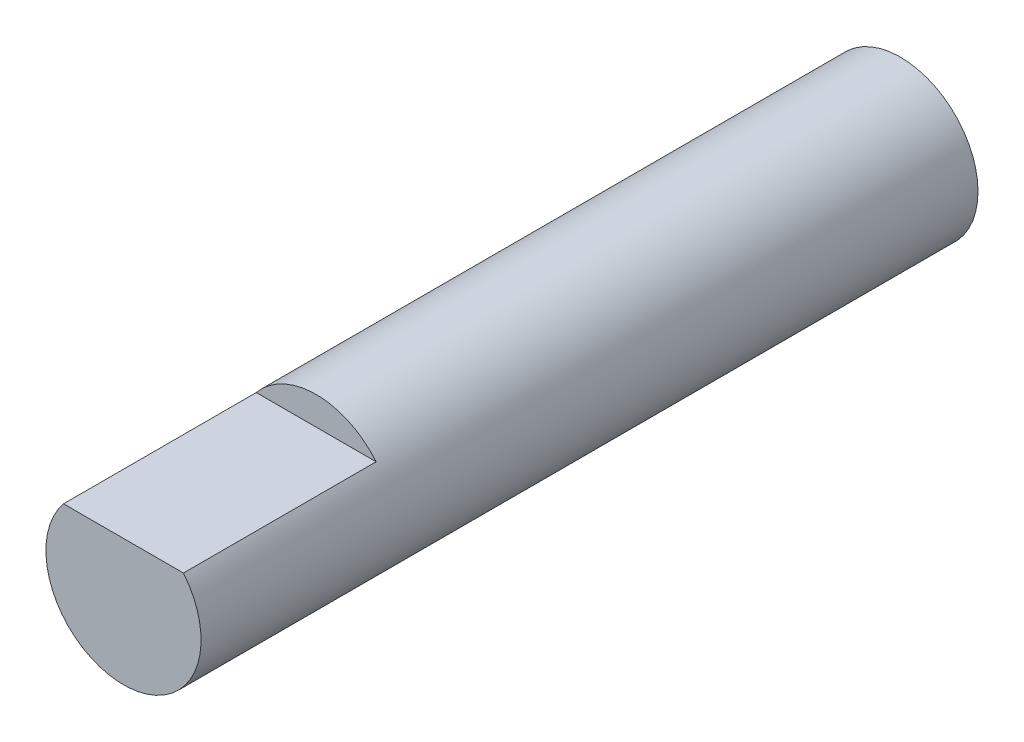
from build123d import *

# Parameters (mm, degrees)
SKETCH1_R          = 3.16992
EXTRUDE1_DEPTH     = 31.75
CUT_EXTRUDE1_START = -7.874
CUT_EXTRUDE1_DEPTH = 7.874


with BuildPart() as part:
    # Sketch1 → Extrude1 (new body)
    with BuildSketch(Plane.XY):
        Circle(SKETCH1_R)
    extrude(amount=EXTRUDE1_DEPTH)

    # Sketch2 → Cut-Extrude1 (cut)
    with BuildSketch(Plane.XY.offset(31.75).offset(CUT_EXTRUDE1_START)):
        with BuildLine():
            Line((-2.449803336, 2.01168), (2.449803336, 2.01168))
            ThreePointArc((2.449803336, 2.01168), (0, 3.16992), (-2.449803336, 2.01168))
        make_face()
    extrude(amount=CUT_EXTRUDE1_DEPTH, mode=Mode.SUBTRACT)


solid = part.part
